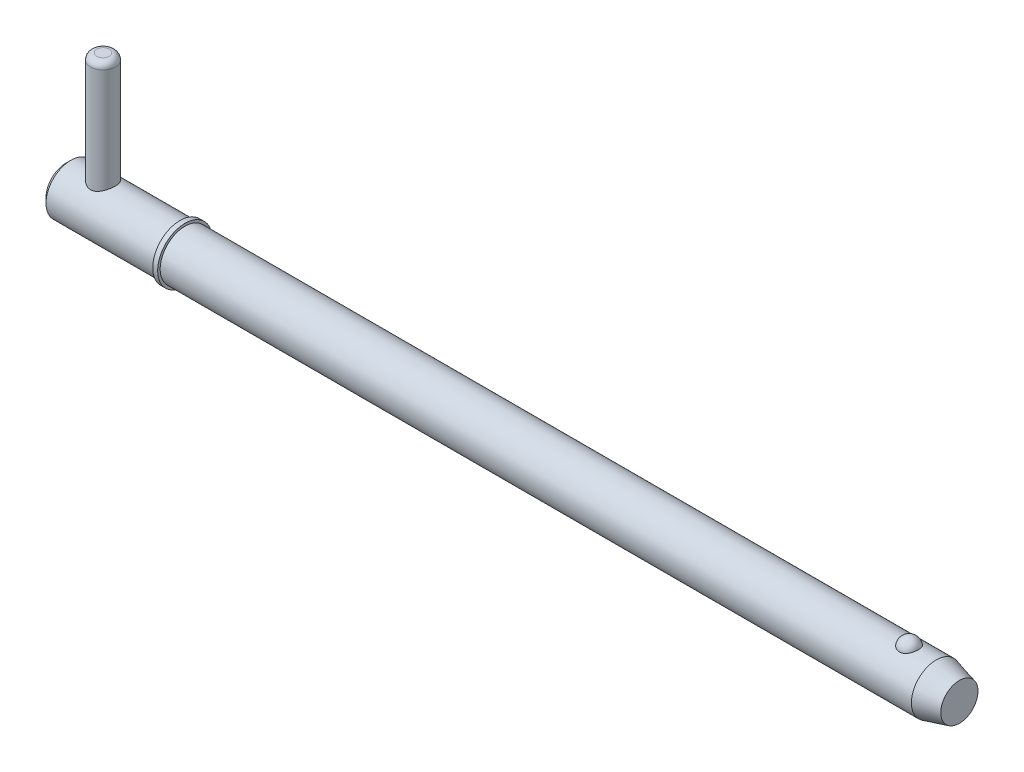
ISO-10303-21;
HEADER;
FILE_DESCRIPTION(('STEP AP214'),'2;1');
FILE_NAME('part.step','',(''),(''),'','','');
FILE_SCHEMA(('AUTOMOTIVE_DESIGN { 1 0 10303 214 1 1 1 1 }'));
ENDSEC;
DATA;
#1=APPLICATION_CONTEXT('core data for automotive mechanical design processes');
#2=APPLICATION_PROTOCOL_DEFINITION('international standard','automotive_design',2000,#1);
#3=PRODUCT_CONTEXT('',#1,'mechanical');
#4=PRODUCT('Part','Part','',(#3));
#5=PRODUCT_RELATED_PRODUCT_CATEGORY('part','',(#4));
#6=PRODUCT_DEFINITION_FORMATION('','',#4);
#7=PRODUCT_DEFINITION_CONTEXT('part definition',#1,'design');
#8=PRODUCT_DEFINITION('design','',#6,#7);
#9=PRODUCT_DEFINITION_SHAPE('','',#8);
#10=(LENGTH_UNIT() NAMED_UNIT(*) SI_UNIT(.MILLI.,.METRE.));
#11=(NAMED_UNIT(*) PLANE_ANGLE_UNIT() SI_UNIT($,.RADIAN.));
#12=(NAMED_UNIT(*) SI_UNIT($,.STERADIAN.) SOLID_ANGLE_UNIT());
#13=UNCERTAINTY_MEASURE_WITH_UNIT(LENGTH_MEASURE(1.E-05),#10,'distance_accuracy_value','');
#14=(GEOMETRIC_REPRESENTATION_CONTEXT(3) GLOBAL_UNCERTAINTY_ASSIGNED_CONTEXT((#13)) GLOBAL_UNIT_ASSIGNED_CONTEXT((#10,
#11,#12)) REPRESENTATION_CONTEXT('',''));
#15=CARTESIAN_POINT('',(0.,0.,0.));
#16=DIRECTION('',(0.,0.,1.));
#17=DIRECTION('',(1.,0.,0.));
#18=AXIS2_PLACEMENT_3D('',#15,#16,#17);
#19=CARTESIAN_POINT('',(5.94,21.43,0.));
#20=DIRECTION('',(0.,-1.,0.));
#21=DIRECTION('',(0.,0.,-1.));
#22=AXIS2_PLACEMENT_3D('',#19,#20,#21);
#23=CYLINDRICAL_SURFACE('',#22,1.98);
#24=CARTESIAN_POINT('',(5.94,-2.98,0.));
#25=DIRECTION('',(0.,1.,0.));
#26=DIRECTION('',(0.,0.,1.));
#27=AXIS2_PLACEMENT_3D('',#24,#25,#26);
#28=CIRCLE('',#27,1.98);
#29=CARTESIAN_POINT('',(5.94,-2.98,1.98));
#30=VERTEX_POINT('',#29);
#31=EDGE_CURVE('P0_E25',#30,#30,#28,.T.);
#32=ORIENTED_EDGE('',*,*,#31,.T.);
#33=EDGE_LOOP('',(#32));
#34=FACE_BOUND('',#33,.T.);
#35=CARTESIAN_POINT('',(5.94,20.44,0.));
#36=DIRECTION('',(0.,1.,0.));
#37=DIRECTION('',(0.,0.,1.));
#38=AXIS2_PLACEMENT_3D('',#35,#36,#37);
#39=CIRCLE('',#38,1.98);
#40=CARTESIAN_POINT('',(5.94,20.44,1.98));
#41=VERTEX_POINT('',#40);
#42=EDGE_CURVE('P0_E29',#41,#41,#39,.F.);
#43=ORIENTED_EDGE('',*,*,#42,.T.);
#44=EDGE_LOOP('',(#43));
#45=FACE_BOUND('',#44,.T.);
#46=ADVANCED_FACE('P0_F14',(#34,#45),#23,.T.);
#47=CARTESIAN_POINT('',(5.94,21.43,0.));
#48=DIRECTION('',(0.,1.,0.));
#49=DIRECTION('',(0.,0.,1.));
#50=AXIS2_PLACEMENT_3D('',#47,#48,#49);
#51=PLANE('',#50);
#52=CARTESIAN_POINT('',(5.94,21.43,0.));
#53=DIRECTION('',(0.,1.,0.));
#54=DIRECTION('',(0.,0.,1.));
#55=AXIS2_PLACEMENT_3D('',#52,#53,#54);
#56=CIRCLE('',#55,0.99);
#57=CARTESIAN_POINT('',(5.94,21.43,0.99));
#58=VERTEX_POINT('',#57);
#59=EDGE_CURVE('P0_E10',#58,#58,#56,.T.);
#60=ORIENTED_EDGE('',*,*,#59,.T.);
#61=EDGE_LOOP('',(#60));
#62=FACE_BOUND('',#61,.T.);
#63=ADVANCED_FACE('P0_F46',(#62),#51,.T.);
#64=CARTESIAN_POINT('',(5.94,-3.97,0.));
#65=DIRECTION('',(0.,1.,0.));
#66=DIRECTION('',(0.,0.,1.));
#67=AXIS2_PLACEMENT_3D('',#64,#65,#66);
#68=PLANE('',#67);
#69=CARTESIAN_POINT('',(5.94,-3.97,0.));
#70=DIRECTION('',(0.,1.,0.));
#71=DIRECTION('',(0.,0.,1.));
#72=AXIS2_PLACEMENT_3D('',#69,#70,#71);
#73=CIRCLE('',#72,0.99);
#74=CARTESIAN_POINT('',(5.94,-3.97,0.99));
#75=VERTEX_POINT('',#74);
#76=EDGE_CURVE('P0_E21',#75,#75,#73,.F.);
#77=ORIENTED_EDGE('',*,*,#76,.T.);
#78=EDGE_LOOP('',(#77));
#79=FACE_BOUND('',#78,.T.);
#80=ADVANCED_FACE('P0_F43',(#79),#68,.F.);
#81=CARTESIAN_POINT('',(5.94,-2.98,0.));
#82=DIRECTION('',(0.,1.,0.));
#83=DIRECTION('',(0.,0.,1.));
#84=AXIS2_PLACEMENT_3D('',#81,#82,#83);
#85=DEGENERATE_TOROIDAL_SURFACE('',#84,0.99,0.99,.T.);
#86=ORIENTED_EDGE('',*,*,#76,.F.);
#87=EDGE_LOOP('',(#86));
#88=FACE_BOUND('',#87,.T.);
#89=ORIENTED_EDGE('',*,*,#31,.F.);
#90=EDGE_LOOP('',(#89));
#91=FACE_BOUND('',#90,.T.);
#92=ADVANCED_FACE('P0_F38',(#88,#91),#85,.T.);
#93=CARTESIAN_POINT('',(5.94,20.44,0.));
#94=DIRECTION('',(0.,1.,0.));
#95=DIRECTION('',(0.,0.,1.));
#96=AXIS2_PLACEMENT_3D('',#93,#94,#95);
#97=DEGENERATE_TOROIDAL_SURFACE('',#96,0.99,0.99,.T.);
#98=ORIENTED_EDGE('',*,*,#42,.F.);
#99=EDGE_LOOP('',(#98));
#100=FACE_BOUND('',#99,.T.);
#101=ORIENTED_EDGE('',*,*,#59,.F.);
#102=EDGE_LOOP('',(#101));
#103=FACE_BOUND('',#102,.T.);
#104=ADVANCED_FACE('P0_F16',(#100,#103),#97,.T.);
#105=CLOSED_SHELL('',(#46,#63,#80,#92,#104));
#106=MANIFOLD_SOLID_BREP('P0_B1',#105);
#107=CARTESIAN_POINT('',(0.,0.,0.));
#108=DIRECTION('',(1.,0.,0.));
#109=DIRECTION('',(0.,0.,-1.));
#110=AXIS2_PLACEMENT_3D('',#107,#108,#109);
#111=CYLINDRICAL_SURFACE('',#110,3.97);
#112=CARTESIAN_POINT('',(139.175939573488,0.,0.));
#113=DIRECTION('',(1.,0.,0.));
#114=DIRECTION('',(0.,0.,-1.));
#115=AXIS2_PLACEMENT_3D('',#112,#113,#114);
#116=CIRCLE('',#115,3.97);
#117=CARTESIAN_POINT('',(139.175939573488,0.,-3.97));
#118=VERTEX_POINT('',#117);
#119=EDGE_CURVE('P1_E81',#118,#118,#116,.T.);
#120=ORIENTED_EDGE('',*,*,#119,.F.);
#121=EDGE_LOOP('',(#120));
#122=FACE_BOUND('',#121,.T.);
#123=CARTESIAN_POINT('',(19.05,0.,0.));
#124=DIRECTION('',(1.,0.,0.));
#125=DIRECTION('',(0.,0.,-1.));
#126=AXIS2_PLACEMENT_3D('',#123,#124,#125);
#127=CIRCLE('',#126,3.97);
#128=CARTESIAN_POINT('',(19.05,0.,-3.97));
#129=VERTEX_POINT('',#128);
#130=EDGE_CURVE('P1_E85',#129,#129,#127,.T.);
#131=ORIENTED_EDGE('',*,*,#130,.T.);
#132=EDGE_LOOP('',(#131));
#133=FACE_BOUND('',#132,.T.);
#134=CARTESIAN_POINT('',(134.845192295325,3.65715365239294,1.54470941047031));
#135=CARTESIAN_POINT('',(134.765244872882,3.65716001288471,1.54470290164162));
#136=CARTESIAN_POINT('',(134.685165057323,3.65987074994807,1.5383254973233));
#137=CARTESIAN_POINT('',(134.527237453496,3.67042218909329,1.51297018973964));
#138=CARTESIAN_POINT('',(134.44939614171,3.67827646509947,1.4939589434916));
#139=CARTESIAN_POINT('',(134.298461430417,3.69818848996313,1.44395950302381));
#140=CARTESIAN_POINT('',(134.225356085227,3.71023513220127,1.41300293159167));
#141=CARTESIAN_POINT('',(134.085563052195,3.73721833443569,1.34000212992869));
#142=CARTESIAN_POINT('',(134.018872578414,3.75215363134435,1.29796274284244));
#143=CARTESIAN_POINT('',(133.89148864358,3.78384968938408,1.20248834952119));
#144=CARTESIAN_POINT('',(133.831029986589,3.800651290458,1.14875388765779));
#145=CARTESIAN_POINT('',(133.719694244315,3.83398532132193,1.03205417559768));
#146=CARTESIAN_POINT('',(133.668820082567,3.85051766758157,0.969086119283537));
#147=CARTESIAN_POINT('',(133.575632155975,3.88238608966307,0.832526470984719));
#148=CARTESIAN_POINT('',(133.533796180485,3.89763698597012,0.758588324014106));
#149=CARTESIAN_POINT('',(133.462510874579,3.92451063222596,0.604352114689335));
#150=CARTESIAN_POINT('',(133.433062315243,3.93613315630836,0.524053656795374));
#151=CARTESIAN_POINT('',(133.386892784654,3.95467606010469,0.358403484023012));
#152=CARTESIAN_POINT('',(133.370312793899,3.96154426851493,0.273006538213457));
#153=CARTESIAN_POINT('',(133.350756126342,3.96967008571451,0.100408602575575));
#154=CARTESIAN_POINT('',(133.347778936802,3.97092790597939,0.0132076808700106));
#155=CARTESIAN_POINT('',(133.355458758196,3.96771794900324,-0.159844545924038));
#156=CARTESIAN_POINT('',(133.366016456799,3.96329187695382,-0.245701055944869));
#157=CARTESIAN_POINT('',(133.40038009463,3.94923163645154,-0.414277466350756));
#158=CARTESIAN_POINT('',(133.424186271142,3.93959737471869,-0.496997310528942));
#159=CARTESIAN_POINT('',(133.48461142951,3.91607752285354,-0.657113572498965));
#160=CARTESIAN_POINT('',(133.521249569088,3.90218558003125,-0.734501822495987));
#161=CARTESIAN_POINT('',(133.606593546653,3.87158287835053,-0.881704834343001));
#162=CARTESIAN_POINT('',(133.655300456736,3.85487186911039,-0.951518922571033));
#163=CARTESIAN_POINT('',(133.764116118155,3.82028735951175,-1.08208159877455));
#164=CARTESIAN_POINT('',(133.824295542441,3.80240713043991,-1.14276958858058));
#165=CARTESIAN_POINT('',(133.954493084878,3.76758161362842,-1.25282437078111));
#166=CARTESIAN_POINT('',(134.024510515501,3.75063626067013,-1.30219195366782));
#167=CARTESIAN_POINT('',(134.17118160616,3.71998948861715,-1.38729709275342));
#168=CARTESIAN_POINT('',(134.247681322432,3.70623183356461,-1.42327904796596));
#169=CARTESIAN_POINT('',(134.406298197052,3.68323188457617,-1.48178996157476));
#170=CARTESIAN_POINT('',(134.4884132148,3.67398788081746,-1.50432401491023));
#171=CARTESIAN_POINT('',(134.651481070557,3.66152163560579,-1.53440939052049));
#172=CARTESIAN_POINT('',(134.732284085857,3.65801951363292,-1.54265826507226));
#173=CARTESIAN_POINT('',(134.89420850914,3.65657341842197,-1.54608423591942));
#174=CARTESIAN_POINT('',(134.975329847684,3.65862829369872,-1.54126404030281));
#175=CARTESIAN_POINT('',(135.132812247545,3.66788969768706,-1.5190847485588));
#176=CARTESIAN_POINT('',(135.209242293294,3.67492621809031,-1.50213925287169));
#177=CARTESIAN_POINT('',(135.358041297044,3.69318404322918,-1.45666982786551));
#178=CARTESIAN_POINT('',(135.430409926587,3.7044056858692,-1.42814496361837));
#179=CARTESIAN_POINT('',(135.570802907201,3.73012749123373,-1.35956319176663));
#180=CARTESIAN_POINT('',(135.638700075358,3.74469307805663,-1.31927107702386));
#181=CARTESIAN_POINT('',(135.766864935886,3.77545272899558,-1.22847440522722));
#182=CARTESIAN_POINT('',(135.827130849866,3.79164717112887,-1.17796747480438));
#183=CARTESIAN_POINT('',(135.941634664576,3.82490325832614,-1.0651926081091));
#184=CARTESIAN_POINT('',(135.995413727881,3.84196735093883,-1.0024591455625));
#185=CARTESIAN_POINT('',(136.092098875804,3.87439863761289,-0.86871586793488));
#186=CARTESIAN_POINT('',(136.135003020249,3.88976552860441,-0.797704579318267));
#187=CARTESIAN_POINT('',(136.210266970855,3.91771381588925,-0.646896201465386));
#188=CARTESIAN_POINT('',(136.24225322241,3.93019255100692,-0.566893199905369));
#189=CARTESIAN_POINT('',(136.293110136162,3.95043886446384,-0.402255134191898));
#190=CARTESIAN_POINT('',(136.311980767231,3.95820643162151,-0.317620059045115));
#191=CARTESIAN_POINT('',(136.33621625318,3.96823733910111,-0.146156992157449));
#192=CARTESIAN_POINT('',(136.341587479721,3.970503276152,-0.0593300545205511));
#193=CARTESIAN_POINT('',(136.338730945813,3.96930811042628,0.114057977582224));
#194=CARTESIAN_POINT('',(136.330503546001,3.9658471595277,0.200619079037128));
#195=CARTESIAN_POINT('',(136.300706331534,3.95358562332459,0.370506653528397));
#196=CARTESIAN_POINT('',(136.27921294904,3.94481563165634,0.453848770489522));
#197=CARTESIAN_POINT('',(136.22338397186,3.92284586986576,0.615497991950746));
#198=CARTESIAN_POINT('',(136.189047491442,3.90964579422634,0.693804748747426));
#199=CARTESIAN_POINT('',(136.107970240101,3.88006987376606,0.843703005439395));
#200=CARTESIAN_POINT('',(136.061153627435,3.86367478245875,0.915249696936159));
#201=CARTESIAN_POINT('',(135.956189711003,3.82949741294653,1.04910810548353));
#202=CARTESIAN_POINT('',(135.898042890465,3.81171519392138,1.11142021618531));
#203=CARTESIAN_POINT('',(135.771743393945,3.7767336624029,1.22503948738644));
#204=CARTESIAN_POINT('',(135.703597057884,3.75953398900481,1.27635357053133));
#205=CARTESIAN_POINT('',(135.558900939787,3.72770506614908,1.36653336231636));
#206=CARTESIAN_POINT('',(135.482348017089,3.7130767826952,1.40539439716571));
#207=CARTESIAN_POINT('',(135.325759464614,3.68864287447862,1.4683048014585));
#208=CARTESIAN_POINT('',(135.245930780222,3.67869017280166,1.49281289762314));
#209=CARTESIAN_POINT('',(135.082987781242,3.66414535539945,1.52817474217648));
#210=CARTESIAN_POINT('',(134.999884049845,3.65953723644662,1.53906926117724));
#211=CARTESIAN_POINT('',(134.892776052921,3.65738948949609,1.54414878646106));
#212=CARTESIAN_POINT('',(134.868990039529,3.65715175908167,1.54471134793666));
#213=CARTESIAN_POINT('',(134.845192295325,3.65715365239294,1.54470941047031));
#214=B_SPLINE_CURVE_WITH_KNOTS('',3,(#134,#135,#136,#137,#138,#139,#140,#141,#142,#143,#144,
#145,#146,#147,#148,#149,#150,#151,#152,#153,#154,#155,#156,#157,#158,#159,#160,#161,#162,#163,
#164,#165,#166,#167,#168,#169,#170,#171,#172,#173,#174,#175,#176,#177,#178,#179,#180,#181,#182,
#183,#184,#185,#186,#187,#188,#189,#190,#191,#192,#193,#194,#195,#196,#197,#198,#199,#200,#201,
#202,#203,#204,#205,#206,#207,#208,#209,#210,#211,#212,#213),.UNSPECIFIED.,.T.,.F.,(4,2,2,2,2,2,
2,2,2,2,2,2,2,2,2,2,2,2,2,2,2,2,2,2,2,2,2,2,2,2,2,2,2,2,2,2,2,2,2,4),(0.,0.239777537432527,
0.48019041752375,0.719971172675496,0.959647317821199,1.20639040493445,1.45320863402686,
1.71093679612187,1.96868099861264,2.22921052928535,2.48973023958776,2.7483492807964,
3.0069729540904,3.2659844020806,3.5250188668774,3.78570385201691,4.0463706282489,
4.30201257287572,4.55755760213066,4.80022994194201,5.04285200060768,5.27757006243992,
5.5123070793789,5.75210128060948,5.9919512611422,6.24392810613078,6.49594987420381,
6.75588818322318,7.01582710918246,7.27564332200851,7.53545264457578,7.79377886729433,
8.05212290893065,8.3120741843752,8.57201437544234,8.83179046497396,9.0916639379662,
9.34270057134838,9.59298357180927,9.66435753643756),.UNSPECIFIED.);
#215=CARTESIAN_POINT('',(134.845192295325,3.65715365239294,1.54470941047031));
#216=VERTEX_POINT('',#215);
#217=EDGE_CURVE('P1_E35',#216,#216,#214,.T.);
#218=ORIENTED_EDGE('',*,*,#217,.T.);
#219=EDGE_LOOP('',(#218));
#220=FACE_BOUND('',#219,.T.);
#221=ADVANCED_FACE('P1_F13',(#122,#133,#220),#111,.T.);
#222=CARTESIAN_POINT('',(0.,0.,0.));
#223=DIRECTION('',(-1.,0.,0.));
#224=DIRECTION('',(0.,0.,1.));
#225=AXIS2_PLACEMENT_3D('',#222,#223,#224);
#226=PLANE('',#225);
#227=CARTESIAN_POINT('',(0.,0.,0.));
#228=DIRECTION('',(1.,0.,0.));
#229=DIRECTION('',(0.,0.,-1.));
#230=AXIS2_PLACEMENT_3D('',#227,#228,#229);
#231=CIRCLE('',#230,3.176);
#232=CARTESIAN_POINT('',(0.,0.,-3.176));
#233=VERTEX_POINT('',#232);
#234=EDGE_CURVE('P1_E9',#233,#233,#231,.T.);
#235=ORIENTED_EDGE('',*,*,#234,.F.);
#236=EDGE_LOOP('',(#235));
#237=FACE_BOUND('',#236,.T.);
#238=ADVANCED_FACE('P1_F15',(#237),#226,.T.);
#239=CARTESIAN_POINT('',(0.793999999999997,0.,0.));
#240=DIRECTION('',(1.,0.,0.));
#241=DIRECTION('',(0.,0.,-1.));
#242=AXIS2_PLACEMENT_3D('',#239,#240,#241);
#243=CONICAL_SURFACE('',#242,3.97,0.78539816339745);
#244=ORIENTED_EDGE('',*,*,#234,.T.);
#245=EDGE_LOOP('',(#244));
#246=FACE_BOUND('',#245,.T.);
#247=CARTESIAN_POINT('',(0.793999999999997,0.,0.));
#248=DIRECTION('',(1.,0.,0.));
#249=DIRECTION('',(0.,0.,-1.));
#250=AXIS2_PLACEMENT_3D('',#247,#248,#249);
#251=CIRCLE('',#250,3.97);
#252=CARTESIAN_POINT('',(0.793999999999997,0.,-3.97));
#253=VERTEX_POINT('',#252);
#254=EDGE_CURVE('P1_E26',#253,#253,#251,.T.);
#255=ORIENTED_EDGE('',*,*,#254,.F.);
#256=EDGE_LOOP('',(#255));
#257=FACE_BOUND('',#256,.T.);
#258=ADVANCED_FACE('P1_F77',(#246,#257),#243,.T.);
#259=CARTESIAN_POINT('',(0.,0.,0.));
#260=DIRECTION('',(1.,0.,0.));
#261=DIRECTION('',(0.,0.,-1.));
#262=AXIS2_PLACEMENT_3D('',#259,#260,#261);
#263=CYLINDRICAL_SURFACE('',#262,3.97);
#264=CARTESIAN_POINT('',(5.94,-3.44100276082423,1.98));
#265=CARTESIAN_POINT('',(5.8367885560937,-3.44101282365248,1.97999171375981));
#266=CARTESIAN_POINT('',(5.73344176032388,-3.44571749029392,1.97187534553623));
#267=CARTESIAN_POINT('',(5.52991905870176,-3.46385873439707,1.93981946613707));
#268=CARTESIAN_POINT('',(5.42975031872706,-3.47731375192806,1.91584653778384));
#269=CARTESIAN_POINT('',(5.23590869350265,-3.51100678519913,1.85336773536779));
#270=CARTESIAN_POINT('',(5.14220446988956,-3.53120882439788,1.81493880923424));
#271=CARTESIAN_POINT('',(4.9625969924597,-3.57606420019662,1.72487335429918));
#272=CARTESIAN_POINT('',(4.87669412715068,-3.6007177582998,1.67323616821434));
#273=CARTESIAN_POINT('',(4.70734412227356,-3.65417020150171,1.55325205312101));
#274=CARTESIAN_POINT('',(4.62467662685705,-3.68314323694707,1.4838818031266));
#275=CARTESIAN_POINT('',(4.47154355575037,-3.74056406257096,1.33252902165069));
#276=CARTESIAN_POINT('',(4.40108404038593,-3.76901158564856,1.25054026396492));
#277=CARTESIAN_POINT('',(4.26974803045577,-3.82445556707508,1.06956584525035));
#278=CARTESIAN_POINT('',(4.20982960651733,-3.8512271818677,0.969809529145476));
#279=CARTESIAN_POINT('',(4.10798077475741,-3.89804342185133,0.760047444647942));
#280=CARTESIAN_POINT('',(4.06603907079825,-3.91809226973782,0.650048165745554));
#281=CARTESIAN_POINT('',(4.00441878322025,-3.94794912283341,0.431181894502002));
#282=CARTESIAN_POINT('',(3.98337329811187,-3.95838209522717,0.322786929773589));
#283=CARTESIAN_POINT('',(3.9596425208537,-3.97016407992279,0.103541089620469));
#284=CARTESIAN_POINT('',(3.95694618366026,-3.97151855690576,-0.00730826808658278));
#285=CARTESIAN_POINT('',(3.9694599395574,-3.96528826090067,-0.218044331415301));
#286=CARTESIAN_POINT('',(3.98314071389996,-3.95846689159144,-0.318049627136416));
#287=CARTESIAN_POINT('',(4.02528522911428,-3.93780347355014,-0.514124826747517));
#288=CARTESIAN_POINT('',(4.05375007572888,-3.92396089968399,-0.61019443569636));
#289=CARTESIAN_POINT('',(4.12484256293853,-3.89028355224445,-0.797351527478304));
#290=CARTESIAN_POINT('',(4.16766142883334,-3.87036821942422,-0.888351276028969));
#291=CARTESIAN_POINT('',(4.26598377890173,-3.82634285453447,-1.06209448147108));
#292=CARTESIAN_POINT('',(4.32149181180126,-3.8022313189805,-1.14483496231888));
#293=CARTESIAN_POINT('',(4.44962332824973,-3.74940011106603,-1.30802500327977));
#294=CARTESIAN_POINT('',(4.52336636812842,-3.72046031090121,-1.38752498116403));
#295=CARTESIAN_POINT('',(4.68287656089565,-3.66269463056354,-1.53354043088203));
#296=CARTESIAN_POINT('',(4.7686527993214,-3.63386885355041,-1.60004599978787));
#297=CARTESIAN_POINT('',(4.9564069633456,-3.57763161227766,-1.72228426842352));
#298=CARTESIAN_POINT('',(5.05906485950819,-3.5504233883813,-1.77707534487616));
#299=CARTESIAN_POINT('',(5.27381412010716,-3.50334038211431,-1.86819784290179));
#300=CARTESIAN_POINT('',(5.38589553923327,-3.48345798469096,-1.90454844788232));
#301=CARTESIAN_POINT('',(5.6069795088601,-3.45548331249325,-1.95481643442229));
#302=CARTESIAN_POINT('',(5.71552407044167,-3.44658268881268,-1.97028113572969));
#303=CARTESIAN_POINT('',(5.93399639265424,-3.43928114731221,-1.98300600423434));
#304=CARTESIAN_POINT('',(6.04392313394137,-3.44087289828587,-1.98027888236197));
#305=CARTESIAN_POINT('',(6.24931618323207,-3.45351901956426,-1.95811780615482));
#306=CARTESIAN_POINT('',(6.34505668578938,-3.46352725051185,-1.94052989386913));
#307=CARTESIAN_POINT('',(6.53204702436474,-3.49033612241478,-1.89188242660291));
#308=CARTESIAN_POINT('',(6.62329540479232,-3.50713894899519,-1.86081853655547));
#309=CARTESIAN_POINT('',(6.80352105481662,-3.54655680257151,-1.78458666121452));
#310=CARTESIAN_POINT('',(6.89219712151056,-3.56940508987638,-1.73883178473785));
#311=CARTESIAN_POINT('',(7.06112449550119,-3.61813012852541,-1.63502913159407));
#312=CARTESIAN_POINT('',(7.14137144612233,-3.6440084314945,-1.57697504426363));
#313=CARTESIAN_POINT('',(7.30168083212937,-3.69977514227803,-1.44171920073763));
#314=CARTESIAN_POINT('',(7.38046039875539,-3.7297597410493,-1.36302972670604));
#315=CARTESIAN_POINT('',(7.52409649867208,-3.78754991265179,-1.19307190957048));
#316=CARTESIAN_POINT('',(7.58894840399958,-3.81535475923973,-1.10179940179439));
#317=CARTESIAN_POINT('',(7.70430122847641,-3.86658972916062,-0.906019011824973));
#318=CARTESIAN_POINT('',(7.75438714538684,-3.88988795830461,-0.801229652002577));
#319=CARTESIAN_POINT('',(7.83572184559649,-3.92848199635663,-0.583216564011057));
#320=CARTESIAN_POINT('',(7.86698708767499,-3.94378479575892,-0.470000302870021));
#321=CARTESIAN_POINT('',(7.90711051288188,-3.96355307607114,-0.249525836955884));
#322=CARTESIAN_POINT('',(7.91775648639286,-3.96888171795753,-0.142669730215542));
#323=CARTESIAN_POINT('',(7.92160247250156,-3.97079858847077,0.0714191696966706));
#324=CARTESIAN_POINT('',(7.91480852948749,-3.96738984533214,0.178651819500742));
#325=CARTESIAN_POINT('',(7.88515479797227,-3.9527181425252,0.383072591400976));
#326=CARTESIAN_POINT('',(7.8633739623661,-3.94198303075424,0.480459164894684));
#327=CARTESIAN_POINT('',(7.80581513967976,-3.91422178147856,0.670038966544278));
#328=CARTESIAN_POINT('',(7.77003513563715,-3.89719473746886,0.762231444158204));
#329=CARTESIAN_POINT('',(7.68389191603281,-3.85747818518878,0.943248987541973));
#330=CARTESIAN_POINT('',(7.63296879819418,-3.83457704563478,1.03175978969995));
#331=CARTESIAN_POINT('',(7.51869140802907,-3.7855122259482,1.19934744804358));
#332=CARTESIAN_POINT('',(7.45533142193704,-3.75934704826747,1.2784199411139));
#333=CARTESIAN_POINT('',(7.31068939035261,-3.70329841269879,1.433144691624));
#334=CARTESIAN_POINT('',(7.22825362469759,-3.67330340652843,1.50768183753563));
#335=CARTESIAN_POINT('',(7.05162367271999,-3.61514025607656,1.64226879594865));
#336=CARTESIAN_POINT('',(6.95741928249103,-3.58697372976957,1.70230590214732));
#337=CARTESIAN_POINT('',(6.75590859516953,-3.53504049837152,1.80775364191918));
#338=CARTESIAN_POINT('',(6.64828786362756,-3.51143624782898,1.85265616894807));
#339=CARTESIAN_POINT('',(6.48137774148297,-3.48289659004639,1.90544537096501));
#340=CARTESIAN_POINT('',(6.42488151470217,-3.4745323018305,1.9206071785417));
#341=CARTESIAN_POINT('',(6.31046920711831,-3.4604244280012,1.94591259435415));
#342=CARTESIAN_POINT('',(6.25255415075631,-3.45467900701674,1.95605971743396));
#343=CARTESIAN_POINT('',(6.1521444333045,-3.44728060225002,1.96905939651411));
#344=CARTESIAN_POINT('',(6.10985721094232,-3.44493297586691,1.97315742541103));
#345=CARTESIAN_POINT('',(6.02505433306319,-3.44179192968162,1.97862952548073));
#346=CARTESIAN_POINT('',(5.98253866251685,-3.44099861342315,1.98000341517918));
#347=CARTESIAN_POINT('',(5.94,-3.44100276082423,1.98));
#348=B_SPLINE_CURVE_WITH_KNOTS('',3,(#264,#265,#266,#267,#268,#269,#270,#271,#272,#273,#274,
#275,#276,#277,#278,#279,#280,#281,#282,#283,#284,#285,#286,#287,#288,#289,#290,#291,#292,#293,
#294,#295,#296,#297,#298,#299,#300,#301,#302,#303,#304,#305,#306,#307,#308,#309,#310,#311,#312,
#313,#314,#315,#316,#317,#318,#319,#320,#321,#322,#323,#324,#325,#326,#327,#328,#329,#330,#331,
#332,#333,#334,#335,#336,#337,#338,#339,#340,#341,#342,#343,#344,#345,#346,#347),.UNSPECIFIED.,
.T.,.F.,(4,2,2,2,2,2,2,2,2,2,2,2,2,2,2,2,2,2,2,2,2,2,2,2,2,2,2,2,2,2,2,2,2,2,2,2,2,2,2,2,2,4),
(0.,0.309462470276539,0.619579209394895,0.928068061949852,1.23657226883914,1.57038619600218,
1.90436536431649,2.26071614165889,2.61684266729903,2.94773555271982,3.27842924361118,
3.58050679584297,3.88260694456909,4.18890317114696,4.49530936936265,4.83057163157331,
5.1660884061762,5.52272472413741,5.87898927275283,6.20706708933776,6.53491569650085,
6.82716910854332,7.11951660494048,7.42541184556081,7.73146442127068,8.07586334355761,
8.42037652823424,8.77380887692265,9.12693169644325,9.44775848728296,9.76847409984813,
10.0682302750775,10.3680296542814,10.6806938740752,10.9935020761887,11.3373031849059,
11.6814044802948,12.0361164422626,12.2131519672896,12.3900632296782,12.5175998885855,
12.6451450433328),.UNSPECIFIED.);
#349=CARTESIAN_POINT('',(5.94,-3.44100276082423,1.98));
#350=VERTEX_POINT('',#349);
#351=EDGE_CURVE('P1_E17',#350,#350,#348,.T.);
#352=ORIENTED_EDGE('',*,*,#351,.F.);
#353=EDGE_LOOP('',(#352));
#354=FACE_BOUND('',#353,.T.);
#355=CARTESIAN_POINT('',(5.94,3.44100276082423,1.98));
#356=CARTESIAN_POINT('',(6.0432114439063,3.44101282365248,1.97999171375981));
#357=CARTESIAN_POINT('',(6.14655823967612,3.44571749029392,1.97187534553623));
#358=CARTESIAN_POINT('',(6.35008094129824,3.46385873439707,1.93981946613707));
#359=CARTESIAN_POINT('',(6.45024968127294,3.47731375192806,1.91584653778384));
#360=CARTESIAN_POINT('',(6.64409130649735,3.51100678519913,1.85336773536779));
#361=CARTESIAN_POINT('',(6.73779553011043,3.53120882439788,1.81493880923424));
#362=CARTESIAN_POINT('',(6.91740300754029,3.57606420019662,1.72487335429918));
#363=CARTESIAN_POINT('',(7.00330587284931,3.6007177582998,1.67323616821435));
#364=CARTESIAN_POINT('',(7.17265587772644,3.65417020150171,1.55325205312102));
#365=CARTESIAN_POINT('',(7.25532337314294,3.68314323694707,1.4838818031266));
#366=CARTESIAN_POINT('',(7.40845644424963,3.74056406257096,1.3325290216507));
#367=CARTESIAN_POINT('',(7.47891595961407,3.76901158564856,1.25054026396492));
#368=CARTESIAN_POINT('',(7.61025196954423,3.82445556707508,1.06956584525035));
#369=CARTESIAN_POINT('',(7.67017039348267,3.8512271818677,0.969809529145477));
#370=CARTESIAN_POINT('',(7.77201922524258,3.89804342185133,0.760047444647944));
#371=CARTESIAN_POINT('',(7.81396092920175,3.91809226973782,0.650048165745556));
#372=CARTESIAN_POINT('',(7.87558121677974,3.94794912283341,0.431181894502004));
#373=CARTESIAN_POINT('',(7.89662670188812,3.95838209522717,0.322786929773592));
#374=CARTESIAN_POINT('',(7.9203574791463,3.97016407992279,0.103541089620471));
#375=CARTESIAN_POINT('',(7.92305381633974,3.97151855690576,-0.00730826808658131));
#376=CARTESIAN_POINT('',(7.9105400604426,3.96528826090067,-0.2180443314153));
#377=CARTESIAN_POINT('',(7.89685928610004,3.95846689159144,-0.318049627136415));
#378=CARTESIAN_POINT('',(7.85471477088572,3.93780347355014,-0.514124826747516));
#379=CARTESIAN_POINT('',(7.82624992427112,3.92396089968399,-0.61019443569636));
#380=CARTESIAN_POINT('',(7.75515743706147,3.89028355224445,-0.797351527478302));
#381=CARTESIAN_POINT('',(7.71233857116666,3.87036821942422,-0.888351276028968));
#382=CARTESIAN_POINT('',(7.61401622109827,3.82634285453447,-1.06209448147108));
#383=CARTESIAN_POINT('',(7.55850818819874,3.8022313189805,-1.14483496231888));
#384=CARTESIAN_POINT('',(7.43037667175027,3.74940011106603,-1.30802500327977));
#385=CARTESIAN_POINT('',(7.35663363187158,3.72046031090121,-1.38752498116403));
#386=CARTESIAN_POINT('',(7.19712343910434,3.66269463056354,-1.53354043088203));
#387=CARTESIAN_POINT('',(7.1113472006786,3.63386885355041,-1.60004599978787));
#388=CARTESIAN_POINT('',(6.9235930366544,3.57763161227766,-1.72228426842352));
#389=CARTESIAN_POINT('',(6.82093514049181,3.5504233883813,-1.77707534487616));
#390=CARTESIAN_POINT('',(6.60618587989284,3.50334038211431,-1.86819784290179));
#391=CARTESIAN_POINT('',(6.49410446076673,3.48345798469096,-1.90454844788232));
#392=CARTESIAN_POINT('',(6.2730204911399,3.45548331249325,-1.95481643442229));
#393=CARTESIAN_POINT('',(6.16447592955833,3.44658268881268,-1.97028113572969));
#394=CARTESIAN_POINT('',(5.94600360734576,3.43928114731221,-1.98300600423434));
#395=CARTESIAN_POINT('',(5.83607686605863,3.44087289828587,-1.98027888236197));
#396=CARTESIAN_POINT('',(5.63068381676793,3.45351901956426,-1.95811780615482));
#397=CARTESIAN_POINT('',(5.53494331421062,3.46352725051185,-1.94052989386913));
#398=CARTESIAN_POINT('',(5.34795297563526,3.49033612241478,-1.89188242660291));
#399=CARTESIAN_POINT('',(5.25670459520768,3.50713894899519,-1.86081853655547));
#400=CARTESIAN_POINT('',(5.07647894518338,3.54655680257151,-1.78458666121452));
#401=CARTESIAN_POINT('',(4.98780287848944,3.56940508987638,-1.73883178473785));
#402=CARTESIAN_POINT('',(4.81887550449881,3.61813012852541,-1.63502913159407));
#403=CARTESIAN_POINT('',(4.73862855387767,3.6440084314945,-1.57697504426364));
#404=CARTESIAN_POINT('',(4.57831916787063,3.69977514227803,-1.44171920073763));
#405=CARTESIAN_POINT('',(4.49953960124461,3.7297597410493,-1.36302972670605));
#406=CARTESIAN_POINT('',(4.35590350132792,3.78754991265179,-1.19307190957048));
#407=CARTESIAN_POINT('',(4.29105159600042,3.81535475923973,-1.10179940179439));
#408=CARTESIAN_POINT('',(4.17569877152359,3.86658972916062,-0.906019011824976));
#409=CARTESIAN_POINT('',(4.12561285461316,3.88988795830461,-0.80122965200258));
#410=CARTESIAN_POINT('',(4.04427815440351,3.92848199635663,-0.58321656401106));
#411=CARTESIAN_POINT('',(4.01301291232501,3.94378479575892,-0.470000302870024));
#412=CARTESIAN_POINT('',(3.97288948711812,3.96355307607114,-0.249525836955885));
#413=CARTESIAN_POINT('',(3.96224351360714,3.96888171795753,-0.142669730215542));
#414=CARTESIAN_POINT('',(3.95839752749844,3.97079858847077,0.0714191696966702));
#415=CARTESIAN_POINT('',(3.96519147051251,3.96738984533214,0.178651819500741));
#416=CARTESIAN_POINT('',(3.99484520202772,3.9527181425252,0.383072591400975));
#417=CARTESIAN_POINT('',(4.01662603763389,3.94198303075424,0.480459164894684));
#418=CARTESIAN_POINT('',(4.07418486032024,3.91422178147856,0.670038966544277));
#419=CARTESIAN_POINT('',(4.10996486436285,3.89719473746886,0.762231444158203));
#420=CARTESIAN_POINT('',(4.19610808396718,3.85747818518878,0.943248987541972));
#421=CARTESIAN_POINT('',(4.24703120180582,3.83457704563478,1.03175978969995));
#422=CARTESIAN_POINT('',(4.36130859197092,3.7855122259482,1.19934744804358));
#423=CARTESIAN_POINT('',(4.42466857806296,3.75934704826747,1.2784199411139));
#424=CARTESIAN_POINT('',(4.56931060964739,3.70329841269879,1.433144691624));
#425=CARTESIAN_POINT('',(4.65174637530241,3.67330340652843,1.50768183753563));
#426=CARTESIAN_POINT('',(4.82837632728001,3.61514025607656,1.64226879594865));
#427=CARTESIAN_POINT('',(4.92258071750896,3.58697372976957,1.70230590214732));
#428=CARTESIAN_POINT('',(5.12409140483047,3.53504049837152,1.80775364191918));
#429=CARTESIAN_POINT('',(5.23171213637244,3.51143624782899,1.85265616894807));
#430=CARTESIAN_POINT('',(5.39862225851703,3.48289659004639,1.90544537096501));
#431=CARTESIAN_POINT('',(5.45511848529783,3.4745323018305,1.9206071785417));
#432=CARTESIAN_POINT('',(5.56953079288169,3.4604244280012,1.94591259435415));
#433=CARTESIAN_POINT('',(5.62744584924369,3.45467900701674,1.95605971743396));
#434=CARTESIAN_POINT('',(5.7278555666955,3.44728060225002,1.9690593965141));
#435=CARTESIAN_POINT('',(5.77014278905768,3.44493297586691,1.97315742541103));
#436=CARTESIAN_POINT('',(5.85494566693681,3.44179192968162,1.97862952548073));
#437=CARTESIAN_POINT('',(5.89746133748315,3.44099861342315,1.98000341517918));
#438=CARTESIAN_POINT('',(5.94,3.44100276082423,1.98));
#439=B_SPLINE_CURVE_WITH_KNOTS('',3,(#355,#356,#357,#358,#359,#360,#361,#362,#363,#364,#365,
#366,#367,#368,#369,#370,#371,#372,#373,#374,#375,#376,#377,#378,#379,#380,#381,#382,#383,#384,
#385,#386,#387,#388,#389,#390,#391,#392,#393,#394,#395,#396,#397,#398,#399,#400,#401,#402,#403,
#404,#405,#406,#407,#408,#409,#410,#411,#412,#413,#414,#415,#416,#417,#418,#419,#420,#421,#422,
#423,#424,#425,#426,#427,#428,#429,#430,#431,#432,#433,#434,#435,#436,#437,#438),.UNSPECIFIED.,
.T.,.F.,(4,2,2,2,2,2,2,2,2,2,2,2,2,2,2,2,2,2,2,2,2,2,2,2,2,2,2,2,2,2,2,2,2,2,2,2,2,2,2,2,2,4),
(0.,0.309462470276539,0.619579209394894,0.928068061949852,1.23657226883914,1.57038619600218,
1.90436536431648,2.26071614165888,2.61684266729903,2.94773555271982,3.27842924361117,
3.58050679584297,3.88260694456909,4.18890317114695,4.49530936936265,4.83057163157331,
5.1660884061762,5.5227247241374,5.87898927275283,6.20706708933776,6.53491569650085,
6.82716910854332,7.11951660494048,7.42541184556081,7.73146442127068,8.07586334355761,
8.42037652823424,8.77380887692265,9.12693169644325,9.44775848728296,9.76847409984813,
10.0682302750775,10.3680296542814,10.6806938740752,10.9935020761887,11.3373031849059,
11.6814044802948,12.0361164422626,12.2131519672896,12.3900632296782,12.5175998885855,
12.6451450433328),.UNSPECIFIED.);
#440=CARTESIAN_POINT('',(5.94,3.44100276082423,1.98));
#441=VERTEX_POINT('',#440);
#442=EDGE_CURVE('P1_E43',#441,#441,#439,.T.);
#443=ORIENTED_EDGE('',*,*,#442,.F.);
#444=EDGE_LOOP('',(#443));
#445=FACE_BOUND('',#444,.T.);
#446=ORIENTED_EDGE('',*,*,#254,.T.);
#447=EDGE_LOOP('',(#446));
#448=FACE_BOUND('',#447,.T.);
#449=CARTESIAN_POINT('',(18.256,0.,0.));
#450=DIRECTION('',(1.,0.,0.));
#451=DIRECTION('',(0.,0.,-1.));
#452=AXIS2_PLACEMENT_3D('',#449,#450,#451);
#453=CIRCLE('',#452,3.97);
#454=CARTESIAN_POINT('',(18.256,0.,-3.97));
#455=VERTEX_POINT('',#454);
#456=EDGE_CURVE('P1_E31',#455,#455,#453,.T.);
#457=ORIENTED_EDGE('',*,*,#456,.F.);
#458=EDGE_LOOP('',(#457));
#459=FACE_BOUND('',#458,.T.);
#460=ADVANCED_FACE('P1_F103',(#354,#445,#448,#459),#263,.T.);
#461=CARTESIAN_POINT('',(18.256,3.97,0.));
#462=DIRECTION('',(-1.,0.,0.));
#463=DIRECTION('',(0.,0.,1.));
#464=AXIS2_PLACEMENT_3D('',#461,#462,#463);
#465=PLANE('',#464);
#466=ORIENTED_EDGE('',*,*,#456,.T.);
#467=EDGE_LOOP('',(#466));
#468=FACE_BOUND('',#467,.T.);
#469=CARTESIAN_POINT('',(18.256,0.,0.));
#470=DIRECTION('',(1.,0.,0.));
#471=DIRECTION('',(0.,0.,-1.));
#472=AXIS2_PLACEMENT_3D('',#469,#470,#471);
#473=CIRCLE('',#472,4.367);
#474=CARTESIAN_POINT('',(18.256,0.,-4.367));
#475=VERTEX_POINT('',#474);
#476=EDGE_CURVE('P1_E91',#475,#475,#473,.T.);
#477=ORIENTED_EDGE('',*,*,#476,.F.);
#478=EDGE_LOOP('',(#477));
#479=FACE_BOUND('',#478,.T.);
#480=ADVANCED_FACE('P1_F100',(#468,#479),#465,.T.);
#481=CARTESIAN_POINT('',(0.,0.,0.));
#482=DIRECTION('',(1.,0.,0.));
#483=DIRECTION('',(0.,0.,-1.));
#484=AXIS2_PLACEMENT_3D('',#481,#482,#483);
#485=CYLINDRICAL_SURFACE('',#484,4.367);
#486=ORIENTED_EDGE('',*,*,#476,.T.);
#487=EDGE_LOOP('',(#486));
#488=FACE_BOUND('',#487,.T.);
#489=CARTESIAN_POINT('',(19.05,0.,0.));
#490=DIRECTION('',(1.,0.,0.));
#491=DIRECTION('',(0.,0.,-1.));
#492=AXIS2_PLACEMENT_3D('',#489,#490,#491);
#493=CIRCLE('',#492,4.367);
#494=CARTESIAN_POINT('',(19.05,0.,-4.367));
#495=VERTEX_POINT('',#494);
#496=EDGE_CURVE('P1_E88',#495,#495,#493,.T.);
#497=ORIENTED_EDGE('',*,*,#496,.F.);
#498=EDGE_LOOP('',(#497));
#499=FACE_BOUND('',#498,.T.);
#500=ADVANCED_FACE('P1_F68',(#488,#499),#485,.T.);
#501=CARTESIAN_POINT('',(19.05,4.367,0.));
#502=DIRECTION('',(1.,0.,0.));
#503=DIRECTION('',(0.,0.,-1.));
#504=AXIS2_PLACEMENT_3D('',#501,#502,#503);
#505=PLANE('',#504);
#506=ORIENTED_EDGE('',*,*,#496,.T.);
#507=EDGE_LOOP('',(#506));
#508=FACE_BOUND('',#507,.T.);
#509=ORIENTED_EDGE('',*,*,#130,.F.);
#510=EDGE_LOOP('',(#509));
#511=FACE_BOUND('',#510,.T.);
#512=ADVANCED_FACE('P1_F62',(#508,#511),#505,.T.);
#513=CARTESIAN_POINT('',(142.88,0.,0.));
#514=DIRECTION('',(-1.,0.,0.));
#515=DIRECTION('',(0.,0.,1.));
#516=AXIS2_PLACEMENT_3D('',#513,#514,#515);
#517=CONICAL_SURFACE('',#516,2.97750000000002,0.26179938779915);
#518=ORIENTED_EDGE('',*,*,#119,.T.);
#519=EDGE_LOOP('',(#518));
#520=FACE_BOUND('',#519,.T.);
#521=CARTESIAN_POINT('',(142.88,0.,0.));
#522=DIRECTION('',(1.,0.,0.));
#523=DIRECTION('',(0.,0.,-1.));
#524=AXIS2_PLACEMENT_3D('',#521,#522,#523);
#525=CIRCLE('',#524,2.97750000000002);
#526=CARTESIAN_POINT('',(142.88,0.,-2.97750000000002));
#527=VERTEX_POINT('',#526);
#528=EDGE_CURVE('P1_E42',#527,#527,#525,.T.);
#529=ORIENTED_EDGE('',*,*,#528,.F.);
#530=EDGE_LOOP('',(#529));
#531=FACE_BOUND('',#530,.T.);
#532=ADVANCED_FACE('P1_F59',(#520,#531),#517,.T.);
#533=CARTESIAN_POINT('',(142.88,2.97750000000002,0.));
#534=DIRECTION('',(1.,0.,0.));
#535=DIRECTION('',(0.,0.,-1.));
#536=AXIS2_PLACEMENT_3D('',#533,#534,#535);
#537=PLANE('',#536);
#538=ORIENTED_EDGE('',*,*,#528,.T.);
#539=EDGE_LOOP('',(#538));
#540=FACE_BOUND('',#539,.T.);
#541=ADVANCED_FACE('P1_F55',(#540),#537,.T.);
#542=CARTESIAN_POINT('',(134.845192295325,3.573,0.));
#543=DIRECTION('',(-1.,0.,0.));
#544=DIRECTION('',(0.,-1.,0.));
#545=AXIS2_PLACEMENT_3D('',#542,#543,#544);
#546=SPHERICAL_SURFACE('',#545,1.54700000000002);
#547=ORIENTED_EDGE('',*,*,#217,.F.);
#548=EDGE_LOOP('',(#547));
#549=FACE_BOUND('',#548,.T.);
#550=ADVANCED_FACE('P1_F50',(#549),#546,.T.);
#551=CARTESIAN_POINT('',(5.94,-4.367,0.));
#552=DIRECTION('',(0.,1.,0.));
#553=DIRECTION('',(0.,0.,1.));
#554=AXIS2_PLACEMENT_3D('',#551,#552,#553);
#555=CYLINDRICAL_SURFACE('',#554,1.98);
#556=ORIENTED_EDGE('',*,*,#351,.T.);
#557=EDGE_LOOP('',(#556));
#558=FACE_BOUND('',#557,.T.);
#559=ORIENTED_EDGE('',*,*,#442,.T.);
#560=EDGE_LOOP('',(#559));
#561=FACE_BOUND('',#560,.T.);
#562=ADVANCED_FACE('P1_F54',(#558,#561),#555,.F.);
#563=CLOSED_SHELL('',(#221,#238,#258,#460,#480,#500,#512,#532,#541,#550,#562));
#564=MANIFOLD_SOLID_BREP('P1_B1',#563);
#565=ADVANCED_BREP_SHAPE_REPRESENTATION('',(#18,#106,#564),#14);
#566=SHAPE_DEFINITION_REPRESENTATION(#9,#565);
ENDSEC;
END-ISO-10303-21;
